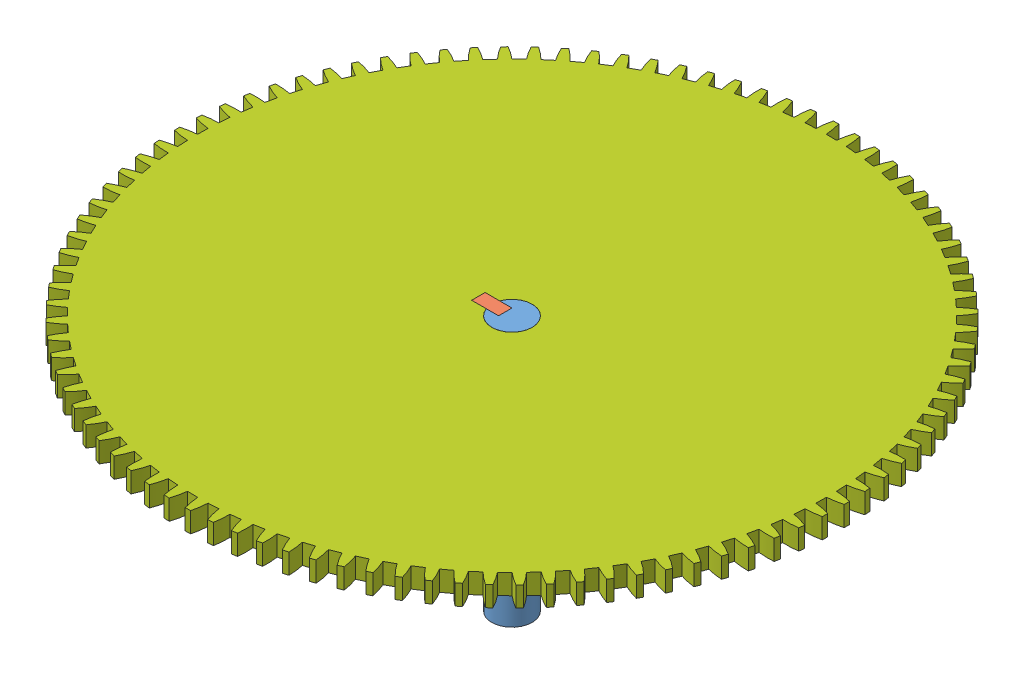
SolidWorks assembly Axle Assembly M.SLDASM, configuration Default (file format 6000). Lengths in mm.
Overall size (49 19 49).
9 component instances, 7 part files, 26 mates.
Components (placement in the parent):
- Axle M-1: Axle M.SLDPRT [Default] at (-46.0803 0.3031 16.1849) size (3 19 3)
- Key-1: Key.SLDPRT [Default] at (-46.0803 13.8031 16.1849) x (-1 0 0) z (0 0 1) size (2 1.5 1)
- Key-2: Key.SLDPRT [Default] at (-46.0803 10.8031 16.1849) x (1 0 0) z (0 0 -1) size (2 1.5 1)
- Gear 15T-1: Gear 15T.sldprt [Default] at (-44.5803 13.8031 16.1849) x (0 0 1) z (1 0 0) size (8.48 1.5 8.44)
- Gear 27T-1: Gear 27T.sldprt [Default] at (-44.5803 10.8031 16.1849) x (0 0 1) z (1 0 0) size (14.49 1.5 14.47)
- Spacer 1.5mm-1: Spacer 1.5mm.SLDPRT [Default] at (-44.5803 10.8031 16.1849) size (4 1.5 4)
- Spacer 6mm-1: Spacer 6mm.SLDPRT [Default] at (-44.5803 9.3031 16.1849) x (-1 0 0) z (0 0 1) size (4 6 4)
- Key-3: Key.SLDPRT [Default] at (-46.0803 17.8031 16.1849) x (-1 0 0) z (0 0 -1) size (2 1.5 1)
- Gear 96T-1: Gear 96T.sldprt [Default] at (-44.5803 17.8031 16.1849) x (0 0 -1) z (1 0 0) size (49 1.5 49)
Mates (geometry in assembly coordinates):
- Coincident1: coincident anti-aligned: plane of Axle M-1 through (-45.0803 9.3031 16.1849) normal (0 1 0); plane of Key-2 through (-46.0803 9.3031 16.1849) normal (0 -1 0)
- Coincident2: coincident anti-aligned: plane of Axle M-1 through (-45.0803 0.3031 16.1849) normal (-1 0 0); plane of Key-2 through (-45.0803 9.3031 15.6849) normal (1 0 0)
- Coincident3: coincident anti-aligned: plane of Axle M-1 through (-45.0803 12.3031 15.6849) normal (0 1 0); plane of Key-1 through (-46.0803 12.3031 16.1849) normal (0 -1 0)
- Coincident4: coincident anti-aligned: plane of Axle M-1 through (-45.0803 10.8031 16.1849) normal (0 -1 0); plane of Key-2 through (-46.0803 10.8031 16.1849) normal (0 1 0)
- Coincident5: coincident anti-aligned: plane of Axle M-1 through (-45.0803 0.3031 16.1849) normal (-1 0 0); plane of Key-2 through (-45.0803 9.3031 15.6849) normal (1 0 0)
- Coincident6: coincident anti-aligned: plane of Axle M-1 through (-45.0803 0.3031 16.6849) normal (0 0 -1); plane of Key-2 through (-47.0803 9.3031 16.6849) normal (0 0 1)
- Coincident7: coincident anti-aligned: plane of Axle M-1 through (-45.0803 0.3031 16.1849) normal (-1 0 0); plane of Key-1 through (-45.0803 12.3031 16.6849) normal (1 0 0)
- Coincident8: coincident anti-aligned: plane of Axle M-1 through (-45.0803 12.3031 16.6849) normal (0 0 -1); plane of Key-1 through (-45.0803 12.3031 16.6849) normal (0 0 1)
- Concentric2: concentric aligned: cylinder of Axle M-1 through (-44.5803 19.3031 16.1849) axis (0 -1 0) radius 1.5; cylinder of Spacer 1.5mm-1 through (-44.5803 12.3031 16.1849) axis (0 -1 0) radius 1.5
- Parallel2: parallel anti-aligned: line of Key-2 through (-47.0803 9.3031 16.6849) axis (0 0 -1); line of Spacer 1.5mm-1 through (-44.5803 10.8031 16.1849) axis (0 0 1)
- Concentric4: concentric anti-aligned: cylinder of Axle M-1 through (-44.5803 19.3031 16.1849) axis (0 -1 0) radius 1.5; cylinder of Spacer 6mm-1 through (-44.5803 3.3031 16.1849) axis (0 1 0) radius 1.5
- Parallel4: parallel anti-aligned: line of Key-2 through (-47.0803 9.3031 16.6849) axis (0 0 -1); line of Spacer 6mm-1 through (-44.5803 9.3031 16.1849) axis (0 0 1)
- Coincident16: coincident anti-aligned: plane of Axle M-1 through (-45.0803 0.3031 16.1849) normal (-1 0 0); plane of Key-3 through (-45.0803 19.3031 15.6849) normal (1 0 0)
- Coincident17: coincident anti-aligned: plane of Axle M-1 through (-45.0803 17.8031 16.6849) normal (0 1 0); plane of Key-3 through (-46.0803 17.8031 16.1849) normal (0 -1 0)
- Coincident18: coincident anti-aligned: plane of Axle M-1 through (-45.0803 19.3031 16.6849) normal (0 0 -1); plane of Key-3 through (-45.0803 19.3031 16.6849) normal (0 0 1)
- Coincident20: coincident anti-aligned: plane of Key-2 through (-46.0803 10.8031 16.1849) normal (0 1 0); plane of Spacer 1.5mm-1 through (-44.5803 10.8031 16.1849) normal (0 -1 0)
- Coincident21: coincident anti-aligned: plane of Key-2 through (-46.0803 9.3031 16.1849) normal (0 -1 0); plane of Spacer 6mm-1 through (-44.5803 9.3031 16.1849) normal (0 1 0)
- Coincident22: coincident aligned: plane of Key-2 through (-46.0803 10.8031 16.1849) normal (0 1 0); plane of Gear 27T-1 through (-42.702 10.8031 7.46) normal (0 1 0)
- Concentric6: concentric anti-aligned: cylinder of Axle M-1 through (-44.5803 19.3031 16.1849) axis (0 -1 0) radius 1.5; cylinder of Gear 27T-1 through (-44.5803 9.3031 16.1849) axis (0 1 0) radius 1.5
- Parallel6: parallel aligned: line of Key-2 through (-47.0803 10.8031 16.6849) axis (0 0 -1); line of Gear 27T-1 through (-47.0803 10.8031 16.6849) axis (0 0 -1)
- Coincident24: coincident aligned: plane of Key-1 through (-46.0803 13.8031 16.1849) normal (0 1 0); plane of Gear 15T-1 through (-43.4533 13.8031 11.2404) normal (0 1 0)
- Concentric7: concentric anti-aligned: cylinder of Axle M-1 through (-44.5803 19.3031 16.1849) axis (0 -1 0) radius 1.5; cylinder of Gear 15T-1 through (-44.5803 12.3031 16.1849) axis (0 1 0) radius 1.5
- Parallel7: parallel aligned: line of Key-1 through (-47.0803 13.8031 16.6849) axis (0 0 -1); line of Gear 15T-1 through (-47.0803 13.8031 16.6849) axis (0 0 -1)
- Coincident26: coincident aligned: plane of Key-3 through (-46.0803 19.3031 16.1849) normal (0 1 0); plane of Gear 96T-1 through (-32.6532 19.3031 53.3264) normal (0 1 0)
- Concentric8: concentric aligned: cylinder of Axle M-1 through (-44.5803 19.3031 16.1849) axis (0 -1 0) radius 1.5; cylinder of Gear 96T-1 through (-44.5803 19.3031 16.1849) axis (0 -1 0) radius 1.5
- Coincident27: coincident aligned: line of Key-3 through (-47.0803 19.3031 15.6849) axis (0 0 1); line of Gear 96T-1 through (-47.0803 19.3031 15.6849) axis (0 0 1)
